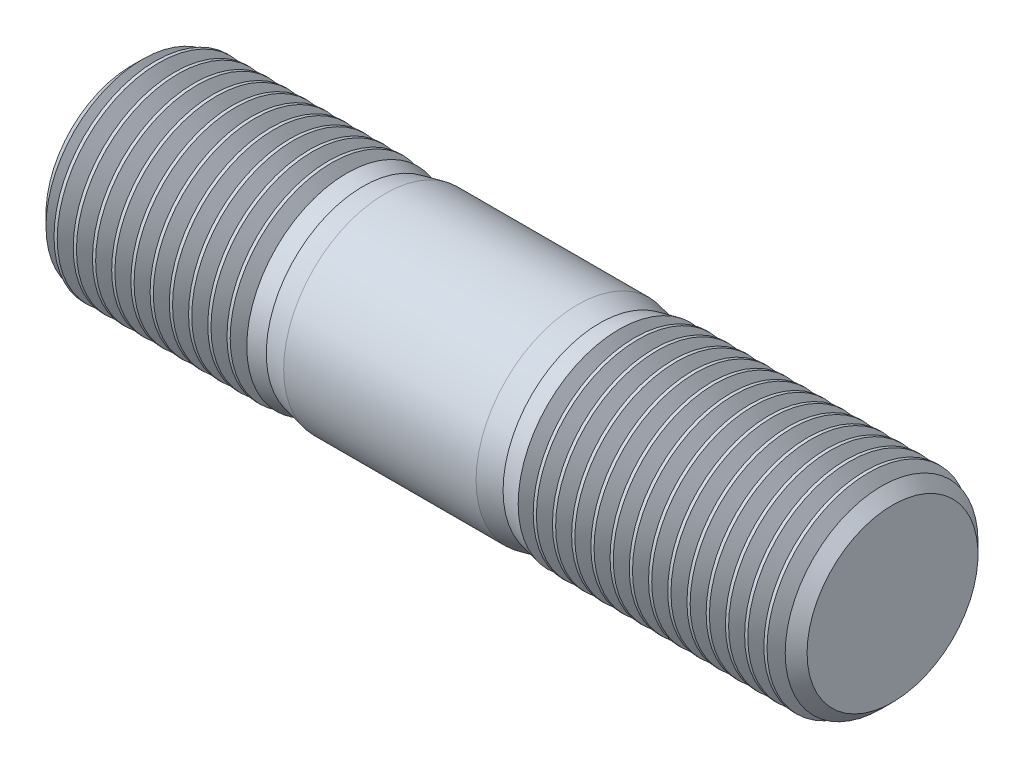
from build123d import *

# Parameters (mm, degrees)
HEADCHAMFER_SIZE = 0.947
LPATTERN10_COUNT = 14
LPATTERN10_PITCH = 1.1364
LPATTERN11_COUNT = 11
LPATTERN11_PITCH = 1.1364


with BuildPart() as part:
    # Sketch1 → BaseHead (revolve)
    with BuildSketch(Plane.XY, mode=Mode.PRIVATE) as basehead_sk:
        Polygon((0, 0), (0, 6), (12.375, 6), (15, 5.4315), (26.375, 5.4315), (29, 6), (45, 6), (45, 0), align=None)
    revolve(basehead_sk.sketch.rotate(Axis((-1.310841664, 0, 0), (1, 0, 0)), 90), axis=Axis((-1.310841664, 0, 0), (1, 0, 0)))

    # HeadChamfer
    headchamfer_edges = [part.edges().sort_by_distance(p)[0] for p in [
        (45, 0, -6),
        (0, 0, -6),
    ]]
    chamfer(headchamfer_edges, length=HEADCHAMFER_SIZE)

    # Sketch2 → BaseBody (revolve)
    with BuildSketch(Plane.XY, mode=Mode.PRIVATE) as basebody_sk:
        Polygon((12.375, 5.4315), (15, 6), (26.375, 6), (29, 5.4315), align=None)
    revolve(basebody_sk.sketch.rotate(Axis((-1.310841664, 0, 0), (1, 0, 0)), 90), axis=Axis((-1.310841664, 0, 0), (1, 0, 0)))

    # Sketch3 → Cut-Revolve10 (revolve, cut)
    with BuildSketch(Plane.XY, mode=Mode.PRIVATE) as cut_revolve10_sk:
        Polygon((44.053, 5.179873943), (44.5265, 6), (44.5265, 6.5), (43.5795, 6.5), (43.5795, 6), align=None)
    cut_revolve10 = revolve(cut_revolve10_sk.sketch.rotate(Axis((0, 0, 0), (1, 0, 0)), 90), axis=Axis((0, 0, 0), (1, 0, 0)), mode=Mode.SUBTRACT)

    # LPattern10: Cut-Revolve10 ×14
    with Locations(*[(-i * LPATTERN10_PITCH, 0, 0) for i in range(1, LPATTERN10_COUNT)]):
        add(cut_revolve10, mode=Mode.SUBTRACT)

    # Sketch4 → Cut-Revolve11 (revolve, cut)
    with BuildSketch(Plane.XY, mode=Mode.PRIVATE) as cut_revolve11_sk:
        Polygon((0.947, 5.179873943), (1.4205, 6), (1.4205, 6.5), (0.4735, 6.5), (0.4735, 6), align=None)
    cut_revolve11 = revolve(cut_revolve11_sk.sketch.rotate(Axis((0, 0, 0), (1, 0, 0)), 90), axis=Axis((0, 0, 0), (1, 0, 0)), mode=Mode.SUBTRACT)

    # LPattern11: Cut-Revolve11 ×11
    with Locations(*[(i * LPATTERN11_PITCH, 0, 0) for i in range(1, LPATTERN11_COUNT)]):
        add(cut_revolve11, mode=Mode.SUBTRACT)


solid = part.part
